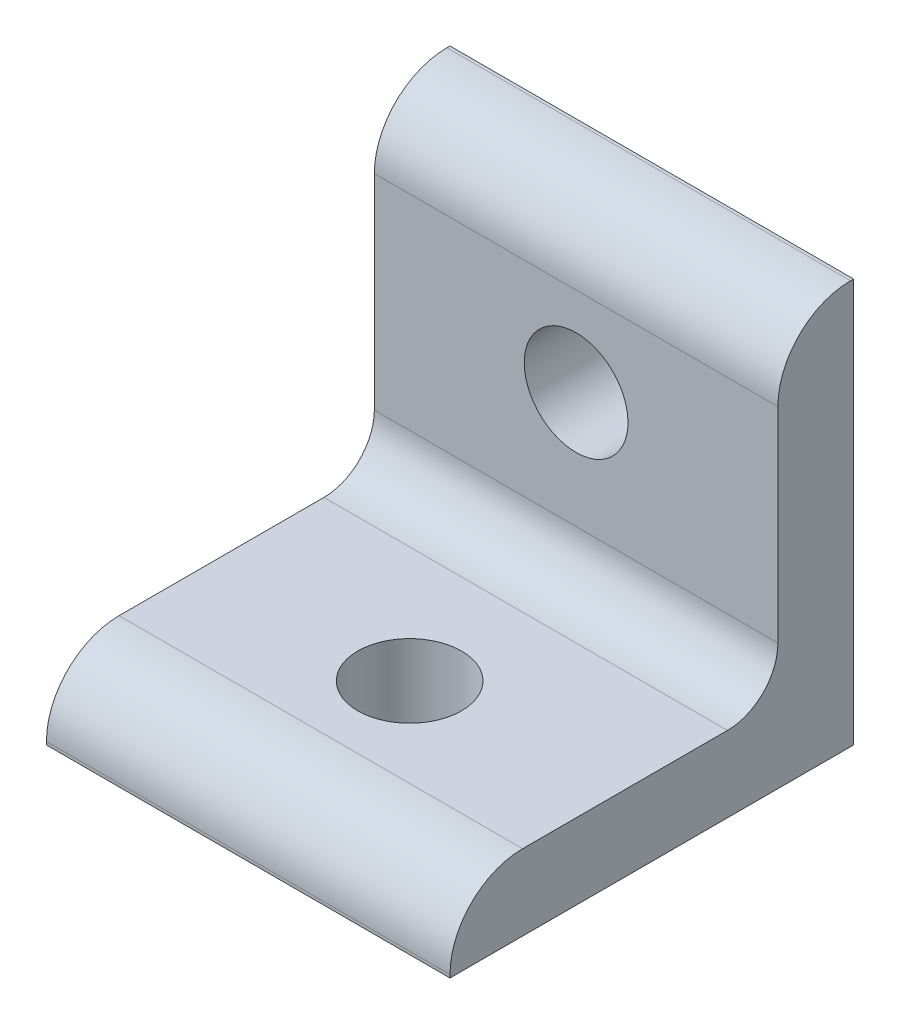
from build123d import *

# Parameters (mm, degrees)
BOSS_EXTRUDE1_DEPTH     = 25.4
F_1_4_CLEARANCE_HOLE1_D = 6.5278
F_1_4_CLEARANCE_HOLE2_D = 6.5278


with BuildPart() as part:
    # Sketch1 → Boss-Extrude1 (new body)
    with BuildSketch(Plane(origin=(0, -22.225, 0), x_dir=(0, -1, 0), z_dir=(-1, 0, 0))):
        with BuildLine():
            Line((-22.225, 0), (-22.225, 25.4))
            Line((-22.225, 25.4), (-22.4155, 25.4))
            ThreePointArc((-22.4155, 25.4), (-25.648392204, 24.060892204), (-26.9875, 20.828))
            Line((-26.9875, 20.828), (-26.9875, 7.9375))
            ThreePointArc((-26.9875, 7.9375), (-27.91743597, 5.69243597), (-30.1625, 4.7625))
            Line((-30.1625, 4.7625), (-43.053, 4.7625))
            ThreePointArc((-43.053, 4.7625), (-46.285892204, 3.423392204), (-47.625, 0.1905))
            Line((-47.625, 0.1905), (-47.625, 0))
            Line((-47.625, 0), (-22.225, 0))
        make_face()
    extrude(amount=-BOSS_EXTRUDE1_DEPTH)

    # 1_4 Clearance Hole1 (through all)
    with Locations(Plane(origin=(0, 0, 0), x_dir=(-1, 0, 0), z_dir=(0, 0, -1))):
        with Locations((-12.7, 15.24)):
            Hole(F_1_4_CLEARANCE_HOLE1_D / 2)

    # 1_4 Clearance Hole2 (through all)
    with Locations(Plane(origin=(0, 0, 0), x_dir=(-1, 0, 0), z_dir=(0, -1, 0))):
        with Locations((-12.7, -15.24)):
            Hole(F_1_4_CLEARANCE_HOLE2_D / 2)


solid = part.part
